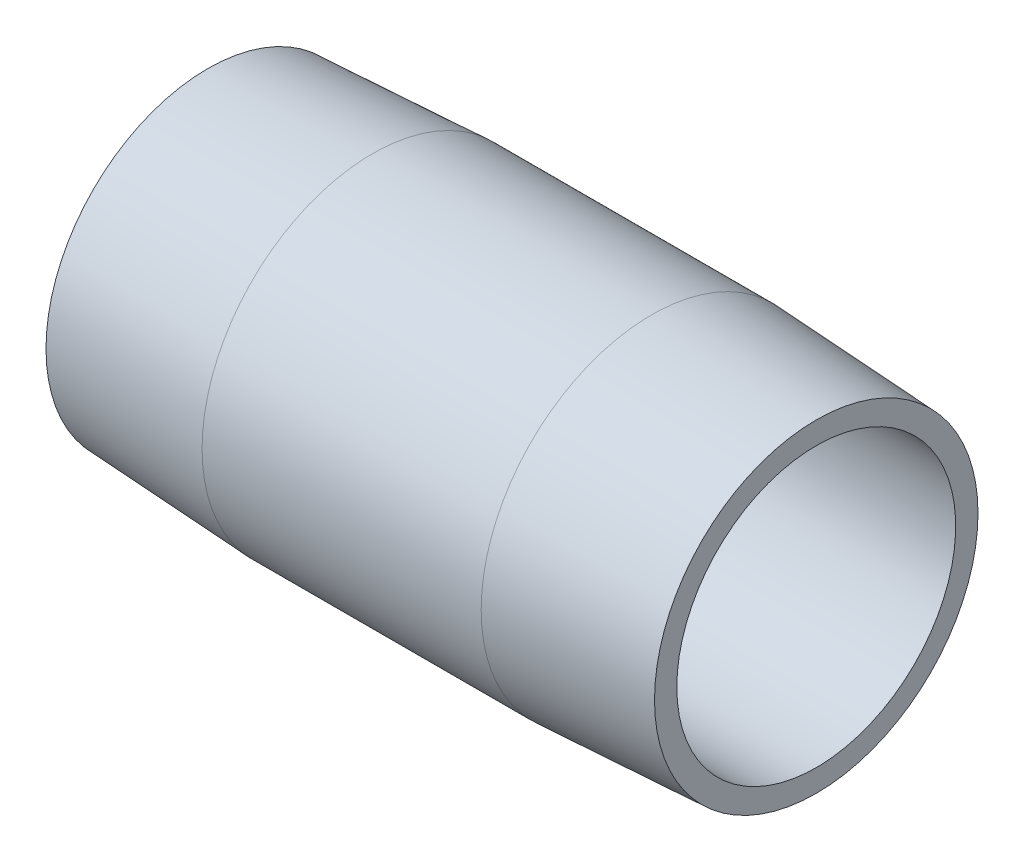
from build123d import *


with BuildPart() as part:
    # Sketch1 → Revolve1 (revolve)
    with BuildSketch(Plane.XY, mode=Mode.PRIVATE) as revolve1_sk:
        Polygon((38.1, 8.73125), (0, 8.73125), (0, 10.127550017), (10.3124, 10.668), (27.7876, 10.668), (38.1, 10.127550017), align=None)
    revolve(revolve1_sk.sketch.rotate(Axis((0, 0, 0), (1, 0, 0)), 90), axis=Axis((0, 0, 0), (1, 0, 0)))


solid = part.part
